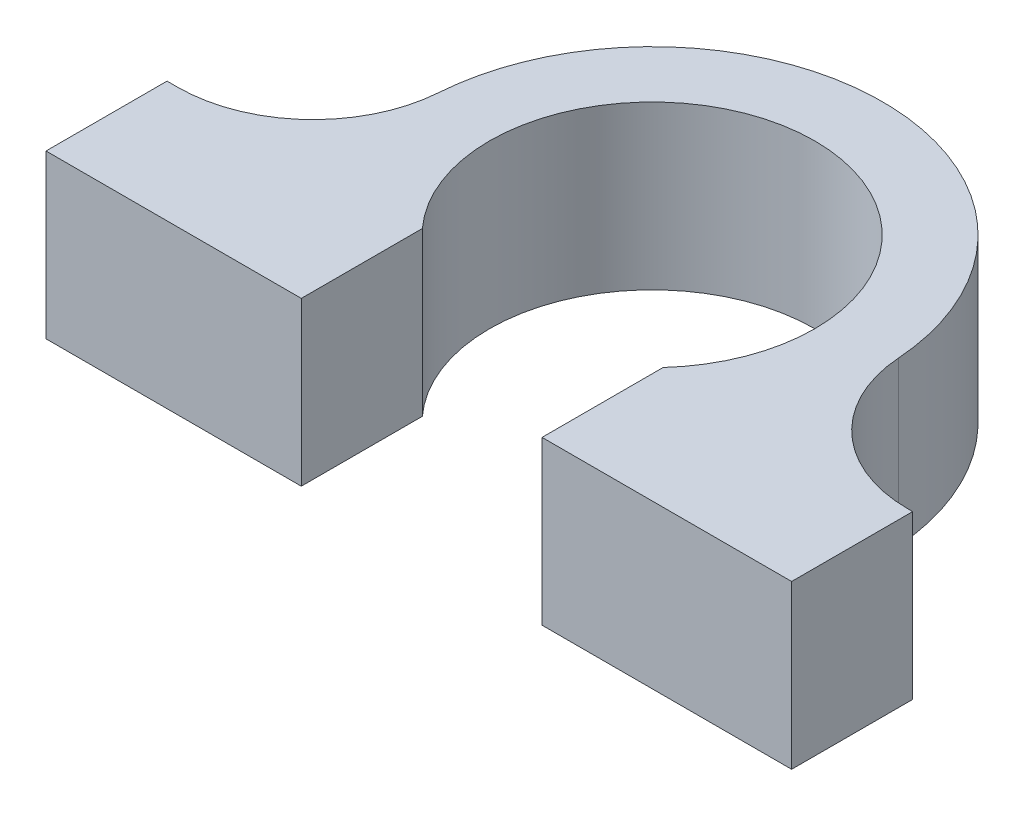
from build123d import *

# Parameters (mm, degrees)
BOSS_EXTRUDE1_DEPTH = 12


with BuildPart() as part:
    # Sketch1 → Boss-Extrude1 (new body)
    with BuildSketch(Plane(origin=(0, 0, 0), x_dir=(1, 0, 0), z_dir=(0, 1, 0))):
        with BuildLine():
            Line((26.931072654, -8.071963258), (27.288946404, -8.071963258))
            Line((27.288946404, -8.071963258), (27.288946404, -17))
            Line((27.288946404, -17), (8.879381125, -17))
            Line((8.879381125, -17), (8.879381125, -8.071963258))
            ThreePointArc((8.879381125, -8.071963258), (0, 12), (-8.879381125, -8.071963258))
            Line((-8.879381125, -8.071963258), (-8.879381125, -17))
            Line((-8.879381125, -17), (-27.711053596, -17))
            Line((-27.711053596, -17), (-27.711053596, -8.071963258))
            Line((-27.711053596, -8.071963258), (-26.931072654, -8.071963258))
            ThreePointArc((-26.931072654, -8.071963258), (-20.117148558, -5.391146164), (-16.956601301, 1.21394906))
            ThreePointArc((-16.956601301, 1.21394906), (0, 17), (16.956601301, 1.21394906))
            ThreePointArc((16.956601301, 1.21394906), (20.117148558, -5.391146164), (26.931072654, -8.071963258))
        make_face()
    extrude(amount=BOSS_EXTRUDE1_DEPTH)


solid = part.part
